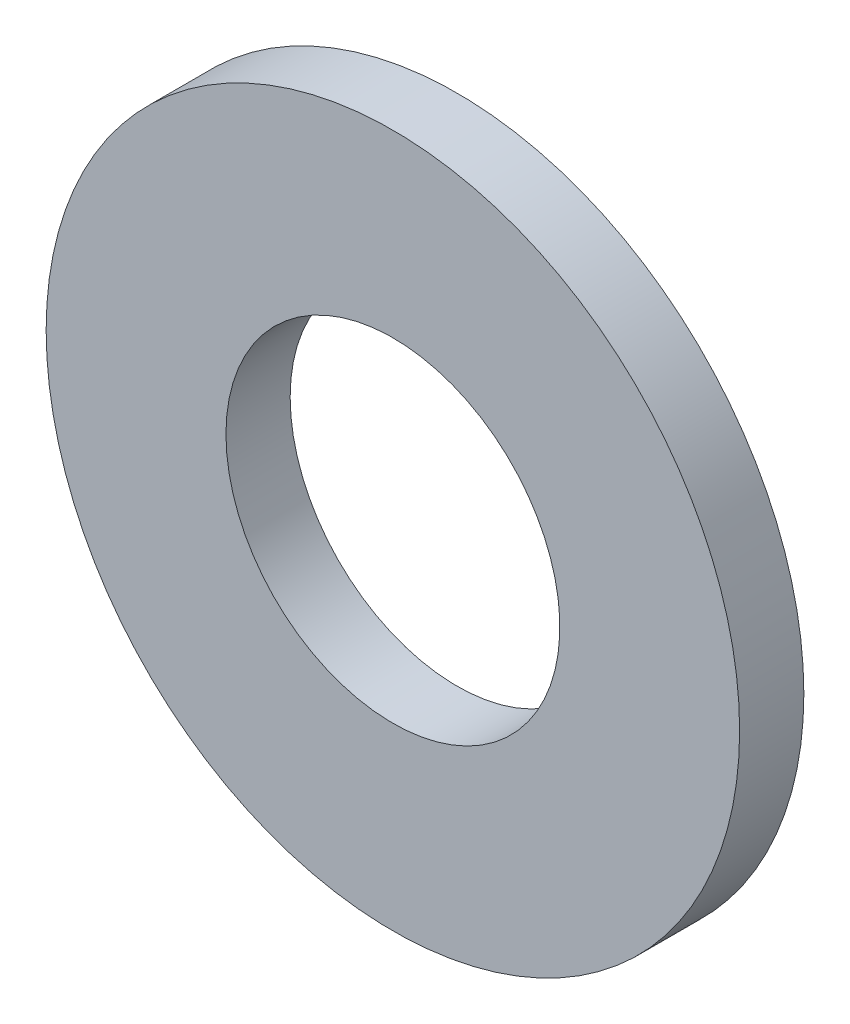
from build123d import *

# Parameters (mm, degrees)
E_CORPS_R              = 13.5
CORPS_DEPTH            = 2.5
E_PER_AGE_R            = 6.5
DIAM_TRE_NOMINAL_DEPTH = 20.254869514


with BuildPart() as part:
    # E_corps → Corps (new body)
    with BuildSketch(Plane.XY):
        Circle(E_CORPS_R)
    extrude(amount=CORPS_DEPTH)

    # E_per_age → Diam_tre_nominal (cut, through all)
    with BuildSketch(Plane(origin=(0, 0, 0), x_dir=(-1, 0, 0), z_dir=(0, 0, -1))):
        Circle(E_PER_AGE_R)
    extrude(amount=-DIAM_TRE_NOMINAL_DEPTH, mode=Mode.SUBTRACT)


solid = part.part
